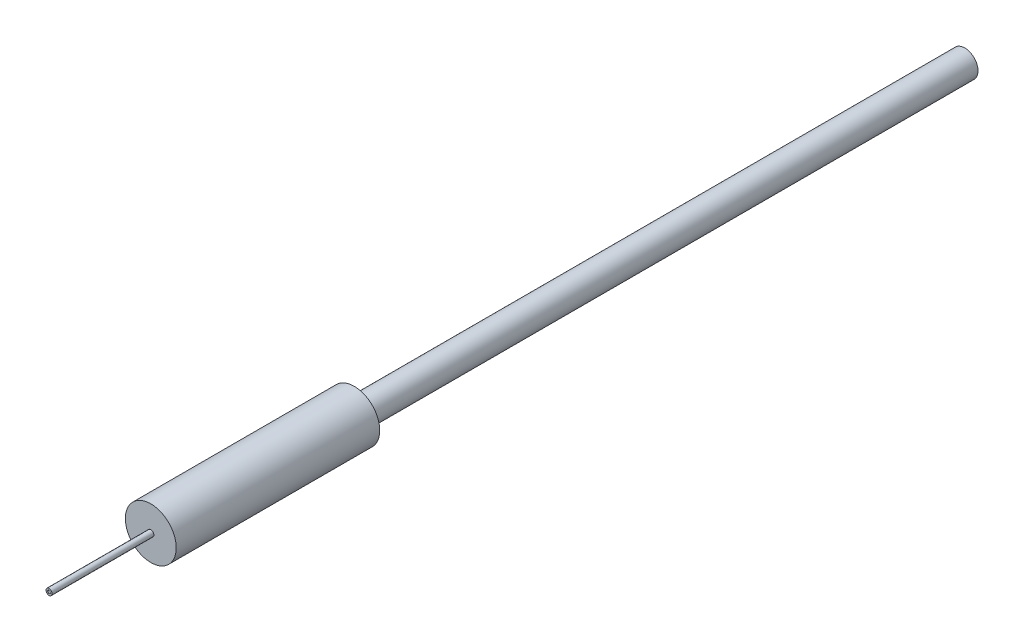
from build123d import *

# Parameters (mm, degrees)
SKETCH_1_R          = 1.25
EXTRUDE_1_DEPTH     = 10
SKETCH_2_R          = 0.15
EXTRUDE_2_DEPTH     = 5
SKETCH_3_R          = 0.65
EXTRUDE_3_DEPTH     = 30
SKETCH_4_R          = 0.0675
SKETCH_4_R_2        = 0.0625
CUT_EXTRUDE_1_DEPTH = 0.1


with BuildPart() as part:
    # Sketch 1 → Extrude 1 (new body)
    with BuildSketch(Plane.XY):
        Circle(SKETCH_1_R)
    extrude(amount=-EXTRUDE_1_DEPTH)

    # Sketch 2 → Extrude 2 (add)
    with BuildSketch(Plane.XY):
        Circle(SKETCH_2_R)
    extrude(amount=EXTRUDE_2_DEPTH)

    # Sketch 3 → Extrude 3 (add)
    with BuildSketch(Plane(origin=(0, 0, -10), x_dir=(-1, 0, 0), z_dir=(0, 0, -1))):
        Circle(SKETCH_3_R)
    extrude(amount=EXTRUDE_3_DEPTH)

    # Sketch 4 → Cut-Extrude 1 (cut)
    with BuildSketch(Plane.XY.offset(5)):
        Circle(SKETCH_4_R)
        Circle(SKETCH_4_R_2, mode=Mode.SUBTRACT)
    extrude(amount=-CUT_EXTRUDE_1_DEPTH, mode=Mode.SUBTRACT)


solid = part.part
